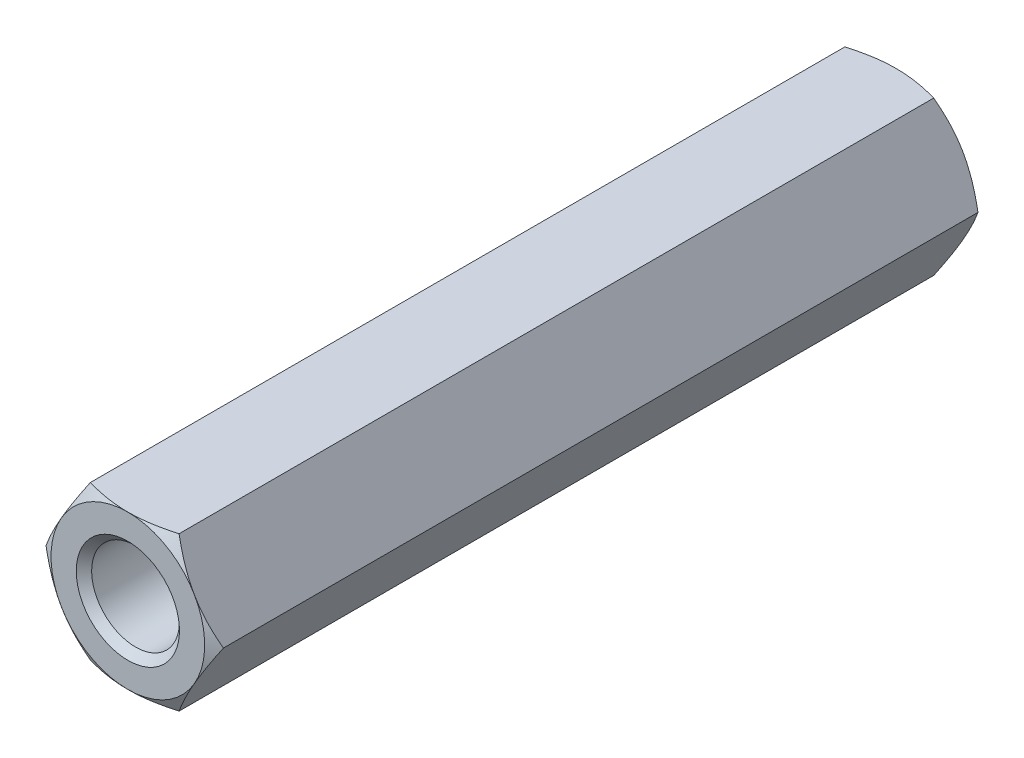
ISO-10303-21;
HEADER;
FILE_DESCRIPTION(('STEP AP214'),'2;1');
FILE_NAME('part.step','',(''),(''),'','','');
FILE_SCHEMA(('AUTOMOTIVE_DESIGN { 1 0 10303 214 1 1 1 1 }'));
ENDSEC;
DATA;
#1=APPLICATION_CONTEXT('core data for automotive mechanical design processes');
#2=APPLICATION_PROTOCOL_DEFINITION('international standard','automotive_design',2000,#1);
#3=PRODUCT_CONTEXT('',#1,'mechanical');
#4=PRODUCT('Part','Part','',(#3));
#5=PRODUCT_RELATED_PRODUCT_CATEGORY('part','',(#4));
#6=PRODUCT_DEFINITION_FORMATION('','',#4);
#7=PRODUCT_DEFINITION_CONTEXT('part definition',#1,'design');
#8=PRODUCT_DEFINITION('design','',#6,#7);
#9=PRODUCT_DEFINITION_SHAPE('','',#8);
#10=(LENGTH_UNIT() NAMED_UNIT(*) SI_UNIT(.MILLI.,.METRE.));
#11=(NAMED_UNIT(*) PLANE_ANGLE_UNIT() SI_UNIT($,.RADIAN.));
#12=(NAMED_UNIT(*) SI_UNIT($,.STERADIAN.) SOLID_ANGLE_UNIT());
#13=UNCERTAINTY_MEASURE_WITH_UNIT(LENGTH_MEASURE(1.E-05),#10,'distance_accuracy_value','');
#14=(GEOMETRIC_REPRESENTATION_CONTEXT(3) GLOBAL_UNCERTAINTY_ASSIGNED_CONTEXT((#13)) GLOBAL_UNIT_ASSIGNED_CONTEXT((#10,
#11,#12)) REPRESENTATION_CONTEXT('',''));
#15=CARTESIAN_POINT('',(0.,0.,0.));
#16=DIRECTION('',(0.,0.,1.));
#17=DIRECTION('',(1.,0.,0.));
#18=AXIS2_PLACEMENT_3D('',#15,#16,#17);
#19=CARTESIAN_POINT('',(4.04145188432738,0.,-17.5));
#20=DIRECTION('',(0.866025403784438,0.5,0.));
#21=DIRECTION('',(-0.5,0.866025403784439,0.));
#22=AXIS2_PLACEMENT_3D('',#19,#20,#21);
#23=PLANE('',#22);
#24=CARTESIAN_POINT('',(4.04156735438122,-0.00019999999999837,17.1873259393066));
#25=CARTESIAN_POINT('',(3.9527667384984,0.153607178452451,17.23861421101));
#26=CARTESIAN_POINT('',(3.86319960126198,0.308742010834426,17.2852590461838));
#27=CARTESIAN_POINT('',(3.68251437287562,0.621698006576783,17.3666781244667));
#28=CARTESIAN_POINT('',(3.59139307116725,0.779524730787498,17.4014235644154));
#29=CARTESIAN_POINT('',(3.41027974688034,1.09322221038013,17.4555099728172));
#30=CARTESIAN_POINT('',(3.32031559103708,1.24904469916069,17.4752109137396));
#31=CARTESIAN_POINT('',(3.13996396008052,1.56142288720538,17.4987298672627));
#32=CARTESIAN_POINT('',(3.04957714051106,1.71797745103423,17.5025673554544));
#33=CARTESIAN_POINT('',(2.88068384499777,2.01050921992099,17.494584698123));
#34=CARTESIAN_POINT('',(2.80215208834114,2.14653021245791,17.4847245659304));
#35=CARTESIAN_POINT('',(2.64560020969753,2.417686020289,17.4534735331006));
#36=CARTESIAN_POINT('',(2.5675806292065,2.55281989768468,17.4320719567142));
#37=CARTESIAN_POINT('',(2.41070596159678,2.82453479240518,17.3785695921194));
#38=CARTESIAN_POINT('',(2.33187072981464,2.96108141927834,17.3462420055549));
#39=CARTESIAN_POINT('',(2.17537608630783,3.2321380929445,17.272871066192));
#40=CARTESIAN_POINT('',(2.09771466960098,3.36665161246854,17.2318449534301));
#41=CARTESIAN_POINT('',(2.02061047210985,3.5002,17.1873259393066));
#42=B_SPLINE_CURVE_WITH_KNOTS('',3,(#24,#25,#26,#27,#28,#29,#30,#31,#32,#33,#34,#35,#36,#37,#38,
#39,#40,#41),.UNSPECIFIED.,.F.,.F.,(4,2,2,2,2,2,2,2,4),(0.,0.554793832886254,1.11092123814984,
1.65328467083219,2.19498204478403,2.6666513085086,3.13875761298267,3.6213361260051,
4.10296698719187),.UNSPECIFIED.);
#43=CARTESIAN_POINT('',(4.04145188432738,0.,17.1873926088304));
#44=VERTEX_POINT('',#43);
#45=CARTESIAN_POINT('',(3.03108891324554,1.75,17.5));
#46=VERTEX_POINT('',#45);
#47=EDGE_CURVE('E171',#44,#46,#42,.T.);
#48=ORIENTED_EDGE('',*,*,#47,.F.);
#49=DIRECTION('',(0.,0.,1.));
#50=VECTOR('',#49,1.);
#51=CARTESIAN_POINT('',(4.04145188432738,0.,-17.5));
#52=LINE('',#51,#50);
#53=CARTESIAN_POINT('',(4.04145188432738,0.,-17.1873926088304));
#54=VERTEX_POINT('',#53);
#55=EDGE_CURVE('E320',#54,#44,#52,.T.);
#56=ORIENTED_EDGE('',*,*,#55,.F.);
#57=CARTESIAN_POINT('',(4.04156735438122,-0.00019999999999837,-17.1873259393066));
#58=CARTESIAN_POINT('',(3.9527667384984,0.153607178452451,-17.23861421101));
#59=CARTESIAN_POINT('',(3.86319960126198,0.308742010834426,-17.2852590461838));
#60=CARTESIAN_POINT('',(3.68251437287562,0.621698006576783,-17.3666781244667));
#61=CARTESIAN_POINT('',(3.59139307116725,0.779524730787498,-17.4014235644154));
#62=CARTESIAN_POINT('',(3.41027974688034,1.09322221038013,-17.4555099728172));
#63=CARTESIAN_POINT('',(3.32031559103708,1.24904469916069,-17.4752109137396));
#64=CARTESIAN_POINT('',(3.13996396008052,1.56142288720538,-17.4987298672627));
#65=CARTESIAN_POINT('',(3.04957714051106,1.71797745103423,-17.5025673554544));
#66=CARTESIAN_POINT('',(2.88068384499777,2.01050921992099,-17.494584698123));
#67=CARTESIAN_POINT('',(2.80215208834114,2.14653021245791,-17.4847245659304));
#68=CARTESIAN_POINT('',(2.64560020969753,2.417686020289,-17.4534735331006));
#69=CARTESIAN_POINT('',(2.5675806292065,2.55281989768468,-17.4320719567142));
#70=CARTESIAN_POINT('',(2.41070596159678,2.82453479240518,-17.3785695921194));
#71=CARTESIAN_POINT('',(2.33187072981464,2.96108141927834,-17.3462420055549));
#72=CARTESIAN_POINT('',(2.17537608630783,3.2321380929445,-17.272871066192));
#73=CARTESIAN_POINT('',(2.09771466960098,3.36665161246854,-17.2318449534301));
#74=CARTESIAN_POINT('',(2.02061047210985,3.5002,-17.1873259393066));
#75=B_SPLINE_CURVE_WITH_KNOTS('',3,(#57,#58,#59,#60,#61,#62,#63,#64,#65,#66,#67,#68,#69,#70,#71,
#72,#73,#74),.UNSPECIFIED.,.F.,.F.,(4,2,2,2,2,2,2,2,4),(0.,0.554793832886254,1.11092123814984,
1.65328467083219,2.19498204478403,2.6666513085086,3.13875761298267,3.6213361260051,
4.10296698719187),.UNSPECIFIED.);
#76=CARTESIAN_POINT('',(3.03108891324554,1.75,-17.5));
#77=VERTEX_POINT('',#76);
#78=EDGE_CURVE('E304',#54,#77,#75,.T.);
#79=ORIENTED_EDGE('',*,*,#78,.T.);
#80=CARTESIAN_POINT('',(2.02072594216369,3.5,-17.1873926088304));
#81=VERTEX_POINT('',#80);
#82=EDGE_CURVE('E251',#77,#81,#75,.T.);
#83=ORIENTED_EDGE('',*,*,#82,.T.);
#84=DIRECTION('',(0.,0.,1.));
#85=VECTOR('',#84,1.);
#86=CARTESIAN_POINT('',(2.02072594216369,3.5,-17.5));
#87=LINE('',#86,#85);
#88=CARTESIAN_POINT('',(2.02072594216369,3.5,17.1873926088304));
#89=VERTEX_POINT('',#88);
#90=EDGE_CURVE('E352',#81,#89,#87,.T.);
#91=ORIENTED_EDGE('',*,*,#90,.T.);
#92=EDGE_CURVE('E147',#46,#89,#42,.T.);
#93=ORIENTED_EDGE('',*,*,#92,.F.);
#94=EDGE_LOOP('',(#48,#56,#79,#83,#91,#93));
#95=FACE_BOUND('',#94,.T.);
#96=ADVANCED_FACE('F41',(#95),#23,.T.);
#97=CARTESIAN_POINT('',(2.02072594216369,-3.5,-17.5));
#98=DIRECTION('',(0.866025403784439,-0.5,0.));
#99=DIRECTION('',(0.5,0.866025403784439,0.));
#100=AXIS2_PLACEMENT_3D('',#97,#98,#99);
#101=PLANE('',#100);
#102=CARTESIAN_POINT('',(2.02061047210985,-3.5002,17.1873259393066));
#103=CARTESIAN_POINT('',(2.10941108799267,-3.34639282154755,17.23861421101));
#104=CARTESIAN_POINT('',(2.19897822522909,-3.19125798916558,17.2852590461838));
#105=CARTESIAN_POINT('',(2.37966345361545,-2.87830199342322,17.3666781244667));
#106=CARTESIAN_POINT('',(2.47078475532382,-2.7204752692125,17.4014235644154));
#107=CARTESIAN_POINT('',(2.65189807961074,-2.40677778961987,17.4555099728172));
#108=CARTESIAN_POINT('',(2.74186223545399,-2.25095530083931,17.4752109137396));
#109=CARTESIAN_POINT('',(2.92221386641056,-1.93857711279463,17.4987298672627));
#110=CARTESIAN_POINT('',(3.01260068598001,-1.78202254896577,17.5025673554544));
#111=CARTESIAN_POINT('',(3.1814939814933,-1.48949078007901,17.494584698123));
#112=CARTESIAN_POINT('',(3.26002573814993,-1.35346978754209,17.4847245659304));
#113=CARTESIAN_POINT('',(3.41657761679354,-1.082313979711,17.4534735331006));
#114=CARTESIAN_POINT('',(3.49459719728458,-0.947180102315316,17.4320719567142));
#115=CARTESIAN_POINT('',(3.65147186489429,-0.675465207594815,17.3785695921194));
#116=CARTESIAN_POINT('',(3.73030709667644,-0.538918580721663,17.3462420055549));
#117=CARTESIAN_POINT('',(3.88680174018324,-0.267861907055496,17.272871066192));
#118=CARTESIAN_POINT('',(3.96446315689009,-0.133348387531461,17.2318449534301));
#119=CARTESIAN_POINT('',(4.04156735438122,0.000200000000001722,17.1873259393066));
#120=B_SPLINE_CURVE_WITH_KNOTS('',3,(#102,#103,#104,#105,#106,#107,#108,#109,#110,#111,#112,
#113,#114,#115,#116,#117,#118,#119),.UNSPECIFIED.,.F.,.F.,(4,2,2,2,2,2,2,2,4),(0.,
0.554793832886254,1.11092123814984,1.65328467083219,2.19498204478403,2.6666513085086,
3.13875761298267,3.6213361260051,4.10296698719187),.UNSPECIFIED.);
#121=CARTESIAN_POINT('',(2.02072594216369,-3.5,17.1873926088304));
#122=VERTEX_POINT('',#121);
#123=CARTESIAN_POINT('',(3.03108891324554,-1.75,17.5));
#124=VERTEX_POINT('',#123);
#125=EDGE_CURVE('E703',#122,#124,#120,.T.);
#126=ORIENTED_EDGE('',*,*,#125,.F.);
#127=DIRECTION('',(0.,0.,1.));
#128=VECTOR('',#127,1.);
#129=CARTESIAN_POINT('',(2.02072594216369,-3.5,-17.5));
#130=LINE('',#129,#128);
#131=CARTESIAN_POINT('',(2.02072594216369,-3.5,-17.1873926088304));
#132=VERTEX_POINT('',#131);
#133=EDGE_CURVE('E383',#132,#122,#130,.T.);
#134=ORIENTED_EDGE('',*,*,#133,.F.);
#135=CARTESIAN_POINT('',(2.02061047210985,-3.5002,-17.1873259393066));
#136=CARTESIAN_POINT('',(2.10941108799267,-3.34639282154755,-17.23861421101));
#137=CARTESIAN_POINT('',(2.19897822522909,-3.19125798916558,-17.2852590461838));
#138=CARTESIAN_POINT('',(2.37966345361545,-2.87830199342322,-17.3666781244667));
#139=CARTESIAN_POINT('',(2.47078475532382,-2.7204752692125,-17.4014235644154));
#140=CARTESIAN_POINT('',(2.65189807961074,-2.40677778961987,-17.4555099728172));
#141=CARTESIAN_POINT('',(2.74186223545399,-2.25095530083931,-17.4752109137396));
#142=CARTESIAN_POINT('',(2.92221386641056,-1.93857711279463,-17.4987298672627));
#143=CARTESIAN_POINT('',(3.01260068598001,-1.78202254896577,-17.5025673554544));
#144=CARTESIAN_POINT('',(3.1814939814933,-1.48949078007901,-17.494584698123));
#145=CARTESIAN_POINT('',(3.26002573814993,-1.35346978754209,-17.4847245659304));
#146=CARTESIAN_POINT('',(3.41657761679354,-1.082313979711,-17.4534735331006));
#147=CARTESIAN_POINT('',(3.49459719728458,-0.947180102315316,-17.4320719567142));
#148=CARTESIAN_POINT('',(3.65147186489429,-0.675465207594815,-17.3785695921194));
#149=CARTESIAN_POINT('',(3.73030709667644,-0.538918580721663,-17.3462420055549));
#150=CARTESIAN_POINT('',(3.88680174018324,-0.267861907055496,-17.272871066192));
#151=CARTESIAN_POINT('',(3.96446315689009,-0.133348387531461,-17.2318449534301));
#152=CARTESIAN_POINT('',(4.04156735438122,0.000200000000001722,-17.1873259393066));
#153=B_SPLINE_CURVE_WITH_KNOTS('',3,(#135,#136,#137,#138,#139,#140,#141,#142,#143,#144,#145,
#146,#147,#148,#149,#150,#151,#152),.UNSPECIFIED.,.F.,.F.,(4,2,2,2,2,2,2,2,4),(0.,
0.554793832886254,1.11092123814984,1.65328467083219,2.19498204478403,2.6666513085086,
3.13875761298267,3.6213361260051,4.10296698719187),.UNSPECIFIED.);
#154=CARTESIAN_POINT('',(3.03108891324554,-1.75,-17.5));
#155=VERTEX_POINT('',#154);
#156=EDGE_CURVE('E335',#132,#155,#153,.T.);
#157=ORIENTED_EDGE('',*,*,#156,.T.);
#158=EDGE_CURVE('E248',#155,#54,#153,.T.);
#159=ORIENTED_EDGE('',*,*,#158,.T.);
#160=ORIENTED_EDGE('',*,*,#55,.T.);
#161=EDGE_CURVE('E175',#124,#44,#120,.T.);
#162=ORIENTED_EDGE('',*,*,#161,.F.);
#163=EDGE_LOOP('',(#126,#134,#157,#159,#160,#162));
#164=FACE_BOUND('',#163,.T.);
#165=ADVANCED_FACE('F332',(#164),#101,.T.);
#166=CARTESIAN_POINT('',(-2.02072594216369,-3.5,-17.5));
#167=DIRECTION('',(0.,-1.,0.));
#168=DIRECTION('',(1.,0.,0.));
#169=AXIS2_PLACEMENT_3D('',#166,#167,#168);
#170=PLANE('',#169);
#171=CARTESIAN_POINT('',(-27.4307731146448,-3.50000000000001,3.55516599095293));
#172=CARTESIAN_POINT('',(-26.8478852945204,-3.50000000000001,3.88898724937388));
#173=CARTESIAN_POINT('',(-26.2649264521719,-3.50000000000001,4.22268456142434));
#174=CARTESIAN_POINT('',(-25.0988291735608,-3.50000000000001,4.88976582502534));
#175=CARTESIAN_POINT('',(-24.5156907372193,-3.50000000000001,5.22314977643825));
#176=CARTESIAN_POINT('',(-22.7659099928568,-3.50000000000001,6.22275607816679));
#177=CARTESIAN_POINT('',(-21.5989427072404,-3.50000000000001,6.88840969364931));
#178=CARTESIAN_POINT('',(-19.2608825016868,-3.50000000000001,8.21892907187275));
#179=CARTESIAN_POINT('',(-18.0897863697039,-3.50000000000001,8.88378919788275));
#180=CARTESIAN_POINT('',(-16.3313824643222,-3.50000000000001,9.87793472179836));
#181=CARTESIAN_POINT('',(-15.7449616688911,-3.50000000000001,10.2087884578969));
#182=CARTESIAN_POINT('',(-14.5712993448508,-3.50000000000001,10.8690364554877));
#183=CARTESIAN_POINT('',(-13.9840578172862,-3.50000000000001,11.1984307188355));
#184=CARTESIAN_POINT('',(-12.8083674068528,-3.5,11.8551710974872));
#185=CARTESIAN_POINT('',(-12.2199184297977,-3.5,12.1825170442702));
#186=CARTESIAN_POINT('',(-11.0412870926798,-3.5,12.8341510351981));
#187=CARTESIAN_POINT('',(-10.451104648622,-3.5,13.1584389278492));
#188=CARTESIAN_POINT('',(-9.56416132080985,-3.5,13.6409988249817));
#189=CARTESIAN_POINT('',(-9.26840501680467,-3.5,13.8011162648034));
#190=CARTESIAN_POINT('',(-8.67602835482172,-3.5,14.1197437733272));
#191=CARTESIAN_POINT('',(-8.37940800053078,-3.5,14.2782538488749));
#192=CARTESIAN_POINT('',(-7.78506999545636,-3.5,14.5931382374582));
#193=CARTESIAN_POINT('',(-7.48735245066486,-3.5,14.749512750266));
#194=CARTESIAN_POINT('',(-6.89042333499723,-3.5,15.0593801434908));
#195=CARTESIAN_POINT('',(-6.5912117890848,-3.5,15.2128730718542));
#196=CARTESIAN_POINT('',(-5.9914121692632,-3.5,15.5154882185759));
#197=CARTESIAN_POINT('',(-5.69082860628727,-3.5,15.6646193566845));
#198=CARTESIAN_POINT('',(-5.08677213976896,-3.5,15.9571138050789));
#199=CARTESIAN_POINT('',(-4.78329871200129,-3.5,16.1004760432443));
#200=CARTESIAN_POINT('',(-4.32445650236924,-3.5,16.3091784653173));
#201=CARTESIAN_POINT('',(-4.17059154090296,-3.5,16.3778203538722));
#202=CARTESIAN_POINT('',(-3.86164226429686,-3.5,16.5122961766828));
#203=CARTESIAN_POINT('',(-3.70655799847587,-3.5,16.5781302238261));
#204=CARTESIAN_POINT('',(-3.39495585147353,-3.5,16.7062535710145));
#205=CARTESIAN_POINT('',(-3.23843822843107,-3.5,16.7685434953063));
#206=CARTESIAN_POINT('',(-2.92369181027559,-3.5,16.8886149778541));
#207=CARTESIAN_POINT('',(-2.76546316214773,-3.5,16.9463969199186));
#208=CARTESIAN_POINT('',(-2.40523508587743,-3.5,17.0706153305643));
#209=CARTESIAN_POINT('',(-2.20263760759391,-3.5,17.1353482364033));
#210=CARTESIAN_POINT('',(-1.79382400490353,-3.5,17.2523701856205));
#211=CARTESIAN_POINT('',(-1.5876080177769,-3.5,17.304659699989));
#212=CARTESIAN_POINT('',(-1.1738163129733,-3.5,17.392237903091));
#213=CARTESIAN_POINT('',(-0.966280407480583,-3.5,17.4277070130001));
#214=CARTESIAN_POINT('',(-0.653209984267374,-3.5,17.4659565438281));
#215=CARTESIAN_POINT('',(-0.548566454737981,-3.5,17.4762138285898));
#216=CARTESIAN_POINT('',(-0.338886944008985,-3.5,17.4914366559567));
#217=CARTESIAN_POINT('',(-0.23385096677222,-3.5,17.4964022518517));
#218=CARTESIAN_POINT('',(-0.0226954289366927,-3.5,17.5008844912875));
#219=CARTESIAN_POINT('',(0.0834252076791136,-3.5,17.5003505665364));
#220=CARTESIAN_POINT('',(0.295492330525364,-3.5,17.493732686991));
#221=CARTESIAN_POINT('',(0.401438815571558,-3.5,17.4876486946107));
#222=CARTESIAN_POINT('',(0.612909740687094,-3.5,17.4701404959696));
#223=CARTESIAN_POINT('',(0.718434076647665,-3.5,17.4587150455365));
#224=CARTESIAN_POINT('',(0.928826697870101,-3.5,17.4308911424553));
#225=CARTESIAN_POINT('',(1.03369493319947,-3.5,17.4144923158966));
#226=CARTESIAN_POINT('',(1.24385359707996,-3.5,17.3769703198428));
#227=CARTESIAN_POINT('',(1.3491343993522,-3.5,17.3557936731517));
#228=CARTESIAN_POINT('',(1.55878625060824,-3.5,17.3093583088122));
#229=CARTESIAN_POINT('',(1.66315728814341,-3.5,17.2840995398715));
#230=CARTESIAN_POINT('',(1.87097734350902,-3.5,17.2300239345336));
#231=CARTESIAN_POINT('',(1.97442628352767,-3.5,17.2012068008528));
#232=CARTESIAN_POINT('',(2.18040838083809,-3.5,17.1405056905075));
#233=CARTESIAN_POINT('',(2.2829415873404,-3.5,17.1086218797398));
#234=CARTESIAN_POINT('',(2.58596452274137,-3.5,17.0101102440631));
#235=CARTESIAN_POINT('',(2.78523134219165,-3.5,16.9397177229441));
#236=CARTESIAN_POINT('',(3.18099665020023,-3.5,16.7914963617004));
#237=CARTESIAN_POINT('',(3.37749434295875,-3.5,16.7136654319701));
#238=CARTESIAN_POINT('',(3.76840303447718,-3.5,16.5524408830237));
#239=CARTESIAN_POINT('',(3.96281183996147,-3.5,16.4690419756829));
#240=CARTESIAN_POINT('',(4.34978417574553,-3.5,16.2981436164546));
#241=CARTESIAN_POINT('',(4.54234789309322,-3.5,16.2106445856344));
#242=CARTESIAN_POINT('',(4.92655192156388,-3.5,16.0322764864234));
#243=CARTESIAN_POINT('',(5.11818819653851,-3.5,15.9413987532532));
#244=CARTESIAN_POINT('',(5.50028894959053,-3.5,15.7572095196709));
#245=CARTESIAN_POINT('',(5.69075340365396,-3.5,15.6638979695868));
#246=CARTESIAN_POINT('',(6.26052950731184,-3.5,15.3812325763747));
#247=CARTESIAN_POINT('',(6.63843539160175,-3.5,15.1890482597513));
#248=CARTESIAN_POINT('',(7.39330119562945,-3.5,14.799050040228));
#249=CARTESIAN_POINT('',(7.77025068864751,-3.5,14.6012160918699));
#250=CARTESIAN_POINT('',(8.52243642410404,-3.5,14.2022077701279));
#251=CARTESIAN_POINT('',(8.8976724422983,-3.5,14.0010329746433));
#252=CARTESIAN_POINT('',(9.64621901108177,-3.5,13.5967028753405));
#253=CARTESIAN_POINT('',(10.0195317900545,-3.5,13.3935516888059));
#254=CARTESIAN_POINT('',(10.7652232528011,-3.5,12.9855407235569));
#255=CARTESIAN_POINT('',(11.1376019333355,-3.5,12.7806809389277));
#256=CARTESIAN_POINT('',(12.1824170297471,-3.5,12.203562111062));
#257=CARTESIAN_POINT('',(12.8540564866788,-3.5,11.8298610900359));
#258=CARTESIAN_POINT('',(14.1958864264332,-3.5,11.0798476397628));
#259=CARTESIAN_POINT('',(14.8660768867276,-3.5,10.7035351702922));
#260=CARTESIAN_POINT('',(16.2059195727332,-3.5,9.94888951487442));
#261=CARTESIAN_POINT('',(16.8755711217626,-3.5,9.57055512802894));
#262=CARTESIAN_POINT('',(18.2141715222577,-3.49999999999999,8.81264546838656));
#263=CARTESIAN_POINT('',(18.8831203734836,-3.49999999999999,8.4330701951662));
#264=CARTESIAN_POINT('',(20.2093475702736,-3.49999999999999,7.67935317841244));
#265=CARTESIAN_POINT('',(20.8666344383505,-3.49999999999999,7.30522642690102));
#266=CARTESIAN_POINT('',(22.1808319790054,-3.49999999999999,6.55631041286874));
#267=CARTESIAN_POINT('',(22.8377426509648,-3.49999999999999,6.18152114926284));
#268=CARTESIAN_POINT('',(24.1508049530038,-3.49999999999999,5.43169950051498));
#269=CARTESIAN_POINT('',(24.8069567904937,-3.49999999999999,5.05666747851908));
#270=CARTESIAN_POINT('',(26.1190260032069,-3.49999999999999,4.30619659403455));
#271=CARTESIAN_POINT('',(26.7749433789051,-3.49999999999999,3.93075773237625));
#272=CARTESIAN_POINT('',(27.4307731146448,-3.49999999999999,3.55516599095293));
#273=B_SPLINE_CURVE_WITH_KNOTS('',3,(#171,#172,#173,#174,#175,#176,#177,#178,#179,#180,#181,
#182,#183,#184,#185,#186,#187,#188,#189,#190,#191,#192,#193,#194,#195,#196,#197,#198,#199,#200,
#201,#202,#203,#204,#205,#206,#207,#208,#209,#210,#211,#212,#213,#214,#215,#216,#217,#218,#219,
#220,#221,#222,#223,#224,#225,#226,#227,#228,#229,#230,#231,#232,#233,#234,#235,#236,#237,#238,
#239,#240,#241,#242,#243,#244,#245,#246,#247,#248,#249,#250,#251,#252,#253,#254,#255,#256,#257,
#258,#259,#260,#261,#262,#263,#264,#265,#266,#267,#268,#269,#270,#271,#272),.UNSPECIFIED.,.F.,
.F.,(4,2,2,2,2,2,2,2,2,2,2,2,2,2,2,2,2,2,2,2,2,2,2,2,2,2,2,2,2,2,2,2,2,2,2,2,2,2,2,2,2,2,2,2,2,
2,2,2,2,2,4),(0.,2.01513118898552,4.03026326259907,8.06066729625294,12.1006546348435,
14.1205992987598,16.1405413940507,18.160647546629,20.180853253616,21.1898018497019,
22.1987461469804,23.2075954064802,24.2164278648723,25.2230280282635,26.2298144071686,
26.7352387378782,27.2406427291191,27.7459574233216,28.2512290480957,28.8889907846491,
29.5267283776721,30.1574613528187,30.4727817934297,30.7880990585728,31.1063182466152,
31.4245395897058,31.7428350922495,32.0611545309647,32.3832311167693,32.7053117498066,
33.0274193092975,33.3495094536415,33.9832827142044,34.6172345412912,35.2517972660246,
35.8862949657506,36.5225504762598,37.1588189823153,38.4306546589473,39.7077661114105,
40.9850401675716,42.2600622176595,43.5350886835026,45.8408897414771,48.146726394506,
50.4541322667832,52.7615389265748,55.0304526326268,57.2993700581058,59.5666718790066,
61.8339690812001),.UNSPECIFIED.);
#274=CARTESIAN_POINT('',(-2.02072594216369,-3.5,17.1873926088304));
#275=VERTEX_POINT('',#274);
#276=CARTESIAN_POINT('',(0.,-3.5,17.5));
#277=VERTEX_POINT('',#276);
#278=EDGE_CURVE('E398',#275,#277,#273,.T.);
#279=ORIENTED_EDGE('',*,*,#278,.F.);
#280=DIRECTION('',(0.,0.,1.));
#281=VECTOR('',#280,1.);
#282=CARTESIAN_POINT('',(-2.02072594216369,-3.5,-17.5));
#283=LINE('',#282,#281);
#284=CARTESIAN_POINT('',(-2.02072594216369,-3.5,-17.1873926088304));
#285=VERTEX_POINT('',#284);
#286=EDGE_CURVE('E384',#285,#275,#283,.T.);
#287=ORIENTED_EDGE('',*,*,#286,.F.);
#288=CARTESIAN_POINT('',(-15.5844804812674,-3.50000000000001,-10.2989034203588));
#289=CARTESIAN_POINT('',(-15.2452756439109,-3.50000000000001,-10.4899769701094));
#290=CARTESIAN_POINT('',(-14.9059481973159,-3.50000000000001,-10.6808333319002));
#291=CARTESIAN_POINT('',(-14.2269801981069,-3.50000000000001,-11.0619912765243));
#292=CARTESIAN_POINT('',(-13.8873396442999,-3.50000000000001,-11.2522928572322));
#293=CARTESIAN_POINT('',(-13.2076108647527,-3.50000000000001,-11.6322580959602));
#294=CARTESIAN_POINT('',(-12.8675225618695,-3.5,-11.8219216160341));
#295=CARTESIAN_POINT('',(-12.1868746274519,-3.5,-12.200400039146));
#296=CARTESIAN_POINT('',(-11.8463149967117,-3.5,-12.3892149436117));
#297=CARTESIAN_POINT('',(-11.1665311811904,-3.5,-12.7646994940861));
#298=CARTESIAN_POINT('',(-10.8273103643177,-3.5,-12.9513752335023));
#299=CARTESIAN_POINT('',(-10.148112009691,-3.5,-13.3233445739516));
#300=CARTESIAN_POINT('',(-9.80813447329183,-3.5,-13.5086381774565));
#301=CARTESIAN_POINT('',(-9.12722539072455,-3.5,-13.8773735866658));
#302=CARTESIAN_POINT('',(-8.78629395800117,-3.5,-14.0608156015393));
#303=CARTESIAN_POINT('',(-8.10310110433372,-3.5,-14.4252006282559));
#304=CARTESIAN_POINT('',(-7.76083969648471,-3.5,-14.6061436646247));
#305=CARTESIAN_POINT('',(-7.06580625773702,-3.5,-14.9690627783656));
#306=CARTESIAN_POINT('',(-6.71298725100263,-3.5,-15.1509493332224));
#307=CARTESIAN_POINT('',(-6.18164231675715,-3.5,-15.4196898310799));
#308=CARTESIAN_POINT('',(-6.00415572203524,-3.5,-15.5085976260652));
#309=CARTESIAN_POINT('',(-5.64833576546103,-3.5,-15.6847003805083));
#310=CARTESIAN_POINT('',(-5.47000241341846,-3.5,-15.7718953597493));
#311=CARTESIAN_POINT('',(-5.11111080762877,-3.5,-15.944713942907));
#312=CARTESIAN_POINT('',(-4.93054564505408,-3.5,-16.0303232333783));
#313=CARTESIAN_POINT('',(-4.56812866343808,-3.5,-16.1987670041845));
#314=CARTESIAN_POINT('',(-4.38627688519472,-3.5,-16.281601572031));
#315=CARTESIAN_POINT('',(-4.0210158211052,-3.5,-16.4436655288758));
#316=CARTESIAN_POINT('',(-3.83760690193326,-3.5,-16.5228957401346));
#317=CARTESIAN_POINT('',(-3.46883117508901,-3.5,-16.6766375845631));
#318=CARTESIAN_POINT('',(-3.28346453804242,-3.5,-16.7511496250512));
#319=CARTESIAN_POINT('',(-2.8844766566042,-3.5,-16.9038033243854));
#320=CARTESIAN_POINT('',(-2.67049635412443,-3.5,-16.9810195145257));
#321=CARTESIAN_POINT('',(-2.23870338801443,-3.5,-17.124163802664));
#322=CARTESIAN_POINT('',(-2.02089019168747,-3.5,-17.1900903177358));
#323=CARTESIAN_POINT('',(-1.58382449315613,-3.5,-17.3055225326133));
#324=CARTESIAN_POINT('',(-1.36462747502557,-3.5,-17.3552304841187));
#325=CARTESIAN_POINT('',(-1.0331648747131,-3.5,-17.414672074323));
#326=CARTESIAN_POINT('',(-0.922243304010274,-3.5,-17.4319649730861));
#327=CARTESIAN_POINT('',(-0.699680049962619,-3.5,-17.4609676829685));
#328=CARTESIAN_POINT('',(-0.588038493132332,-3.5,-17.4726784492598));
#329=CARTESIAN_POINT('',(-0.362202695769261,-3.5,-17.4902543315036));
#330=CARTESIAN_POINT('',(-0.247999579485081,-3.5,-17.496006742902));
#331=CARTESIAN_POINT('',(-0.0194502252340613,-3.5,-17.5010445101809));
#332=CARTESIAN_POINT('',(0.0948960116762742,-3.5,-17.5003299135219));
#333=CARTESIAN_POINT('',(0.323373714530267,-3.5,-17.4924617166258));
#334=CARTESIAN_POINT('',(0.437505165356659,-3.5,-17.4853076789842));
#335=CARTESIAN_POINT('',(0.665204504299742,-3.5,-17.4648539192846));
#336=CARTESIAN_POINT('',(0.778772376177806,-3.5,-17.4515540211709));
#337=CARTESIAN_POINT('',(1.12102809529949,-3.5,-17.4027463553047));
#338=CARTESIAN_POINT('',(1.34849603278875,-3.5,-17.3584444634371));
#339=CARTESIAN_POINT('',(1.68635720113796,-3.5,-17.2784669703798));
#340=CARTESIAN_POINT('',(1.79845994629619,-3.5,-17.2495410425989));
#341=CARTESIAN_POINT('',(2.02159924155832,-3.5,-17.1878238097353));
#342=CARTESIAN_POINT('',(2.1326358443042,-3.5,-17.155032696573));
#343=CARTESIAN_POINT('',(2.43075829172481,-3.5,-17.0621643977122));
#344=CARTESIAN_POINT('',(2.6168801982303,-3.5,-16.9990055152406));
#345=CARTESIAN_POINT('',(2.98658767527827,-3.5,-16.8656116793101));
#346=CARTESIAN_POINT('',(3.17017257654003,-3.5,-16.7953748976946));
#347=CARTESIAN_POINT('',(3.53538002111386,-3.5,-16.6495174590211));
#348=CARTESIAN_POINT('',(3.71700053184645,-3.5,-16.5738917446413));
#349=CARTESIAN_POINT('',(4.07847905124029,-3.5,-16.4186070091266));
#350=CARTESIAN_POINT('',(4.25833722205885,-3.5,-16.3389483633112));
#351=CARTESIAN_POINT('',(4.6171061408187,-3.5,-16.176312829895));
#352=CARTESIAN_POINT('',(4.79601320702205,-3.5,-16.0933278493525));
#353=CARTESIAN_POINT('',(5.15267432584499,-3.5,-15.9249152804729));
#354=CARTESIAN_POINT('',(5.33042835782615,-3.5,-15.8394876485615));
#355=CARTESIAN_POINT('',(5.86209855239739,-3.5,-15.5804292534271));
#356=CARTESIAN_POINT('',(6.2146171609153,-3.5,-15.4039334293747));
#357=CARTESIAN_POINT('',(6.918512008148,-3.5,-15.0452916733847));
#358=CARTESIAN_POINT('',(7.26987817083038,-3.5,-14.8631261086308));
#359=CARTESIAN_POINT('',(7.97085512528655,-3.5,-14.4953518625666));
#360=CARTESIAN_POINT('',(8.3204656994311,-3.5,-14.3097427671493));
#361=CARTESIAN_POINT('',(9.01784108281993,-3.5,-13.9363878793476));
#362=CARTESIAN_POINT('',(9.36560791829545,-3.5,-13.7486458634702));
#363=CARTESIAN_POINT('',(10.0601754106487,-3.5,-13.3713819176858));
#364=CARTESIAN_POINT('',(10.4069760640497,-3.5,-13.1818599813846));
#365=CARTESIAN_POINT('',(11.1587907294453,-3.5,-12.7691123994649));
#366=CARTESIAN_POINT('',(11.5636687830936,-3.5,-12.5456392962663));
#367=CARTESIAN_POINT('',(12.3728327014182,-3.5,-12.0972466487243));
#368=CARTESIAN_POINT('',(12.7771182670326,-3.5,-11.872326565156));
#369=CARTESIAN_POINT('',(13.5822471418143,-3.5,-11.4230554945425));
#370=CARTESIAN_POINT('',(13.9830945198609,-3.5,-11.198711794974));
#371=CARTESIAN_POINT('',(14.7841769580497,-3.5,-10.7493114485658));
#372=CARTESIAN_POINT('',(15.1844121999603,-3.5,-10.5242551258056));
#373=CARTESIAN_POINT('',(15.5844804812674,-3.5,-10.2989034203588));
#374=B_SPLINE_CURVE_WITH_KNOTS('',3,(#288,#289,#290,#291,#292,#293,#294,#295,#296,#297,#298,
#299,#300,#301,#302,#303,#304,#305,#306,#307,#308,#309,#310,#311,#312,#313,#314,#315,#316,#317,
#318,#319,#320,#321,#322,#323,#324,#325,#326,#327,#328,#329,#330,#331,#332,#333,#334,#335,#336,
#337,#338,#339,#340,#341,#342,#343,#344,#345,#346,#347,#348,#349,#350,#351,#352,#353,#354,#355,
#356,#357,#358,#359,#360,#361,#362,#363,#364,#365,#366,#367,#368,#369,#370,#371,#372,#373),
.UNSPECIFIED.,.F.,.F.,(4,2,2,2,2,2,2,2,2,2,2,2,2,2,2,2,2,2,2,2,2,2,2,2,2,2,2,2,2,2,2,2,2,2,2,2,
2,2,2,2,2,2,4),(0.,1.16795626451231,2.33591699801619,3.50411581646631,4.67231266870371,
5.83388988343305,6.99546502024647,8.1569074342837,9.31833844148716,10.5091305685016,
11.1046525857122,11.700167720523,12.2996447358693,12.8991028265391,13.4984234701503,
14.0976923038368,14.7799197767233,15.4622428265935,16.1356992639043,16.4723646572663,
16.8089724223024,17.1518370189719,17.4946990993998,17.8375844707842,18.180479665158,
18.8745527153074,19.221835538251,19.5691011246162,20.1585328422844,20.7481171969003,
21.338262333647,21.9283526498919,22.5199780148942,23.1116139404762,24.2942439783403,
25.48156449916,26.6690287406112,27.8546442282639,29.0402639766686,30.4276313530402,
31.8155497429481,33.1936192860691,34.5711329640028),.UNSPECIFIED.);
#375=CARTESIAN_POINT('',(0.,-3.5,-17.5));
#376=VERTEX_POINT('',#375);
#377=EDGE_CURVE('E345',#285,#376,#374,.T.);
#378=ORIENTED_EDGE('',*,*,#377,.T.);
#379=EDGE_CURVE('E276',#376,#132,#374,.T.);
#380=ORIENTED_EDGE('',*,*,#379,.T.);
#381=ORIENTED_EDGE('',*,*,#133,.T.);
#382=EDGE_CURVE('E211',#277,#122,#273,.T.);
#383=ORIENTED_EDGE('',*,*,#382,.F.);
#384=EDGE_LOOP('',(#279,#287,#378,#380,#381,#383));
#385=FACE_BOUND('',#384,.T.);
#386=ADVANCED_FACE('F234',(#385),#170,.T.);
#387=CARTESIAN_POINT('',(-4.04145188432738,0.,-17.5));
#388=DIRECTION('',(-0.866025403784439,-0.5,0.));
#389=DIRECTION('',(0.5,-0.866025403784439,0.));
#390=AXIS2_PLACEMENT_3D('',#387,#388,#389);
#391=PLANE('',#390);
#392=CARTESIAN_POINT('',(-4.04156735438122,0.000199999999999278,17.1873259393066));
#393=CARTESIAN_POINT('',(-3.9527667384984,-0.15360717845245,17.23861421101));
#394=CARTESIAN_POINT('',(-3.86319960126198,-0.308742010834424,17.2852590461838));
#395=CARTESIAN_POINT('',(-3.68251437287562,-0.621698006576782,17.3666781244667));
#396=CARTESIAN_POINT('',(-3.59139307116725,-0.779524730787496,17.4014235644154));
#397=CARTESIAN_POINT('',(-3.41027974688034,-1.09322221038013,17.4555099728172));
#398=CARTESIAN_POINT('',(-3.32031559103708,-1.24904469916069,17.4752109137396));
#399=CARTESIAN_POINT('',(-3.13996396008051,-1.56142288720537,17.4987298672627));
#400=CARTESIAN_POINT('',(-3.04957714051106,-1.71797745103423,17.5025673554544));
#401=CARTESIAN_POINT('',(-2.88068384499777,-2.01050921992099,17.494584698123));
#402=CARTESIAN_POINT('',(-2.80215208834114,-2.14653021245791,17.4847245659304));
#403=CARTESIAN_POINT('',(-2.64560020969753,-2.417686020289,17.4534735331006));
#404=CARTESIAN_POINT('',(-2.56758062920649,-2.55281989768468,17.4320719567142));
#405=CARTESIAN_POINT('',(-2.41070596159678,-2.82453479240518,17.3785695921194));
#406=CARTESIAN_POINT('',(-2.33187072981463,-2.96108141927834,17.3462420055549));
#407=CARTESIAN_POINT('',(-2.17537608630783,-3.2321380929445,17.272871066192));
#408=CARTESIAN_POINT('',(-2.09771466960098,-3.36665161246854,17.2318449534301));
#409=CARTESIAN_POINT('',(-2.02061047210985,-3.5002,17.1873259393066));
#410=B_SPLINE_CURVE_WITH_KNOTS('',3,(#392,#393,#394,#395,#396,#397,#398,#399,#400,#401,#402,
#403,#404,#405,#406,#407,#408,#409),.UNSPECIFIED.,.F.,.F.,(4,2,2,2,2,2,2,2,4),(0.,
0.554793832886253,1.11092123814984,1.65328467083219,2.19498204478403,2.6666513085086,
3.13875761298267,3.6213361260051,4.10296698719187),.UNSPECIFIED.);
#411=CARTESIAN_POINT('',(-4.04145188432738,0.,17.1873926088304));
#412=VERTEX_POINT('',#411);
#413=CARTESIAN_POINT('',(-3.03108891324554,-1.75,17.5));
#414=VERTEX_POINT('',#413);
#415=EDGE_CURVE('E156',#412,#414,#410,.T.);
#416=ORIENTED_EDGE('',*,*,#415,.F.);
#417=DIRECTION('',(0.,0.,1.));
#418=VECTOR('',#417,1.);
#419=CARTESIAN_POINT('',(-4.04145188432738,0.,-17.5));
#420=LINE('',#419,#418);
#421=CARTESIAN_POINT('',(-4.04145188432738,0.,-17.1873926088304));
#422=VERTEX_POINT('',#421);
#423=EDGE_CURVE('E169',#422,#412,#420,.T.);
#424=ORIENTED_EDGE('',*,*,#423,.F.);
#425=CARTESIAN_POINT('',(-4.04156735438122,0.000199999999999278,-17.1873259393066));
#426=CARTESIAN_POINT('',(-3.9527667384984,-0.15360717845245,-17.23861421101));
#427=CARTESIAN_POINT('',(-3.86319960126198,-0.308742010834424,-17.2852590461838));
#428=CARTESIAN_POINT('',(-3.68251437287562,-0.621698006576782,-17.3666781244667));
#429=CARTESIAN_POINT('',(-3.59139307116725,-0.779524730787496,-17.4014235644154));
#430=CARTESIAN_POINT('',(-3.41027974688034,-1.09322221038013,-17.4555099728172));
#431=CARTESIAN_POINT('',(-3.32031559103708,-1.24904469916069,-17.4752109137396));
#432=CARTESIAN_POINT('',(-3.13996396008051,-1.56142288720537,-17.4987298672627));
#433=CARTESIAN_POINT('',(-3.04957714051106,-1.71797745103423,-17.5025673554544));
#434=CARTESIAN_POINT('',(-2.88068384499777,-2.01050921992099,-17.494584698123));
#435=CARTESIAN_POINT('',(-2.80215208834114,-2.14653021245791,-17.4847245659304));
#436=CARTESIAN_POINT('',(-2.64560020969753,-2.417686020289,-17.4534735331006));
#437=CARTESIAN_POINT('',(-2.56758062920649,-2.55281989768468,-17.4320719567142));
#438=CARTESIAN_POINT('',(-2.41070596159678,-2.82453479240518,-17.3785695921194));
#439=CARTESIAN_POINT('',(-2.33187072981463,-2.96108141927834,-17.3462420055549));
#440=CARTESIAN_POINT('',(-2.17537608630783,-3.2321380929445,-17.272871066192));
#441=CARTESIAN_POINT('',(-2.09771466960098,-3.36665161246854,-17.2318449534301));
#442=CARTESIAN_POINT('',(-2.02061047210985,-3.5002,-17.1873259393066));
#443=B_SPLINE_CURVE_WITH_KNOTS('',3,(#425,#426,#427,#428,#429,#430,#431,#432,#433,#434,#435,
#436,#437,#438,#439,#440,#441,#442),.UNSPECIFIED.,.F.,.F.,(4,2,2,2,2,2,2,2,4),(0.,
0.554793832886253,1.11092123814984,1.65328467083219,2.19498204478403,2.6666513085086,
3.13875761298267,3.6213361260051,4.10296698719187),.UNSPECIFIED.);
#444=CARTESIAN_POINT('',(-3.03108891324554,-1.75,-17.5));
#445=VERTEX_POINT('',#444);
#446=EDGE_CURVE('E239',#422,#445,#443,.T.);
#447=ORIENTED_EDGE('',*,*,#446,.T.);
#448=EDGE_CURVE('E250',#445,#285,#443,.T.);
#449=ORIENTED_EDGE('',*,*,#448,.T.);
#450=ORIENTED_EDGE('',*,*,#286,.T.);
#451=EDGE_CURVE('E177',#414,#275,#410,.T.);
#452=ORIENTED_EDGE('',*,*,#451,.F.);
#453=EDGE_LOOP('',(#416,#424,#447,#449,#450,#452));
#454=FACE_BOUND('',#453,.T.);
#455=ADVANCED_FACE('F231',(#454),#391,.T.);
#456=CARTESIAN_POINT('',(-2.02072594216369,3.5,-17.5));
#457=DIRECTION('',(-0.866025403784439,0.5,0.));
#458=DIRECTION('',(-0.5,-0.866025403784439,0.));
#459=AXIS2_PLACEMENT_3D('',#456,#457,#458);
#460=PLANE('',#459);
#461=CARTESIAN_POINT('',(-2.02061047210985,3.5002,17.1873259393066));
#462=CARTESIAN_POINT('',(-2.10941108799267,3.34639282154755,17.23861421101));
#463=CARTESIAN_POINT('',(-2.19897822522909,3.19125798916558,17.2852590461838));
#464=CARTESIAN_POINT('',(-2.37966345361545,2.87830199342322,17.3666781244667));
#465=CARTESIAN_POINT('',(-2.47078475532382,2.7204752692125,17.4014235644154));
#466=CARTESIAN_POINT('',(-2.65189807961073,2.40677778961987,17.4555099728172));
#467=CARTESIAN_POINT('',(-2.74186223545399,2.25095530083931,17.4752109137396));
#468=CARTESIAN_POINT('',(-2.92221386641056,1.93857711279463,17.4987298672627));
#469=CARTESIAN_POINT('',(-3.01260068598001,1.78202254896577,17.5025673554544));
#470=CARTESIAN_POINT('',(-3.1814939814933,1.48949078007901,17.494584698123));
#471=CARTESIAN_POINT('',(-3.26002573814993,1.35346978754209,17.4847245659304));
#472=CARTESIAN_POINT('',(-3.41657761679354,1.082313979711,17.4534735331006));
#473=CARTESIAN_POINT('',(-3.49459719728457,0.947180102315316,17.4320719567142));
#474=CARTESIAN_POINT('',(-3.65147186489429,0.675465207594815,17.3785695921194));
#475=CARTESIAN_POINT('',(-3.73030709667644,0.538918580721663,17.3462420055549));
#476=CARTESIAN_POINT('',(-3.88680174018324,0.267861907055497,17.272871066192));
#477=CARTESIAN_POINT('',(-3.96446315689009,0.133348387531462,17.2318449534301));
#478=CARTESIAN_POINT('',(-4.04156735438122,-0.000200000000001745,17.1873259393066));
#479=B_SPLINE_CURVE_WITH_KNOTS('',3,(#461,#462,#463,#464,#465,#466,#467,#468,#469,#470,#471,
#472,#473,#474,#475,#476,#477,#478),.UNSPECIFIED.,.F.,.F.,(4,2,2,2,2,2,2,2,4),(0.,
0.554793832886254,1.11092123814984,1.65328467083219,2.19498204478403,2.6666513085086,
3.13875761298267,3.6213361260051,4.10296698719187),.UNSPECIFIED.);
#480=CARTESIAN_POINT('',(-2.02072594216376,3.5,17.1873926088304));
#481=VERTEX_POINT('',#480);
#482=CARTESIAN_POINT('',(-3.03108891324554,1.75,17.5));
#483=VERTEX_POINT('',#482);
#484=EDGE_CURVE('E135',#481,#483,#479,.T.);
#485=ORIENTED_EDGE('',*,*,#484,.F.);
#486=DIRECTION('',(0.,0.,1.));
#487=VECTOR('',#486,1.);
#488=CARTESIAN_POINT('',(-2.02072594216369,3.5,-17.5));
#489=LINE('',#488,#487);
#490=CARTESIAN_POINT('',(-2.02072594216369,3.5,-17.1873926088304));
#491=VERTEX_POINT('',#490);
#492=EDGE_CURVE('E355',#491,#481,#489,.T.);
#493=ORIENTED_EDGE('',*,*,#492,.F.);
#494=CARTESIAN_POINT('',(-2.02061047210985,3.5002,-17.1873259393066));
#495=CARTESIAN_POINT('',(-2.10941108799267,3.34639282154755,-17.23861421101));
#496=CARTESIAN_POINT('',(-2.19897822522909,3.19125798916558,-17.2852590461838));
#497=CARTESIAN_POINT('',(-2.37966345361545,2.87830199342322,-17.3666781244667));
#498=CARTESIAN_POINT('',(-2.47078475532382,2.7204752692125,-17.4014235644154));
#499=CARTESIAN_POINT('',(-2.65189807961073,2.40677778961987,-17.4555099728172));
#500=CARTESIAN_POINT('',(-2.74186223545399,2.25095530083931,-17.4752109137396));
#501=CARTESIAN_POINT('',(-2.92221386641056,1.93857711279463,-17.4987298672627));
#502=CARTESIAN_POINT('',(-3.01260068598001,1.78202254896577,-17.5025673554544));
#503=CARTESIAN_POINT('',(-3.1814939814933,1.48949078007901,-17.494584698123));
#504=CARTESIAN_POINT('',(-3.26002573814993,1.35346978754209,-17.4847245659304));
#505=CARTESIAN_POINT('',(-3.41657761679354,1.082313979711,-17.4534735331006));
#506=CARTESIAN_POINT('',(-3.49459719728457,0.947180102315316,-17.4320719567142));
#507=CARTESIAN_POINT('',(-3.65147186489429,0.675465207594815,-17.3785695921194));
#508=CARTESIAN_POINT('',(-3.73030709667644,0.538918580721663,-17.3462420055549));
#509=CARTESIAN_POINT('',(-3.88680174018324,0.267861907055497,-17.272871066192));
#510=CARTESIAN_POINT('',(-3.96446315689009,0.133348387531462,-17.2318449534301));
#511=CARTESIAN_POINT('',(-4.04156735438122,-0.000200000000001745,-17.1873259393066));
#512=B_SPLINE_CURVE_WITH_KNOTS('',3,(#494,#495,#496,#497,#498,#499,#500,#501,#502,#503,#504,
#505,#506,#507,#508,#509,#510,#511),.UNSPECIFIED.,.F.,.F.,(4,2,2,2,2,2,2,2,4),(0.,
0.554793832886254,1.11092123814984,1.65328467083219,2.19498204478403,2.6666513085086,
3.13875761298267,3.6213361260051,4.10296698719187),.UNSPECIFIED.);
#513=CARTESIAN_POINT('',(-3.03108891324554,1.75,-17.5));
#514=VERTEX_POINT('',#513);
#515=EDGE_CURVE('E292',#491,#514,#512,.T.);
#516=ORIENTED_EDGE('',*,*,#515,.T.);
#517=EDGE_CURVE('E249',#514,#422,#512,.T.);
#518=ORIENTED_EDGE('',*,*,#517,.T.);
#519=ORIENTED_EDGE('',*,*,#423,.T.);
#520=EDGE_CURVE('E150',#483,#412,#479,.T.);
#521=ORIENTED_EDGE('',*,*,#520,.F.);
#522=EDGE_LOOP('',(#485,#493,#516,#518,#519,#521));
#523=FACE_BOUND('',#522,.T.);
#524=ADVANCED_FACE('F166',(#523),#460,.T.);
#525=CARTESIAN_POINT('',(2.02072594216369,3.5,-17.5));
#526=DIRECTION('',(0.,1.,0.));
#527=DIRECTION('',(0.,0.,1.));
#528=AXIS2_PLACEMENT_3D('',#525,#526,#527);
#529=PLANE('',#528);
#530=CARTESIAN_POINT('',(27.4307731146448,3.5,3.55516599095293));
#531=CARTESIAN_POINT('',(26.8478852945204,3.5,3.88898724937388));
#532=CARTESIAN_POINT('',(26.2649264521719,3.5,4.22268456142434));
#533=CARTESIAN_POINT('',(25.0988291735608,3.5,4.88976582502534));
#534=CARTESIAN_POINT('',(24.5156907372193,3.5,5.22314977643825));
#535=CARTESIAN_POINT('',(22.7659099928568,3.5,6.22275607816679));
#536=CARTESIAN_POINT('',(21.5989427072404,3.5,6.88840969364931));
#537=CARTESIAN_POINT('',(19.2608825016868,3.5,8.21892907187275));
#538=CARTESIAN_POINT('',(18.0897863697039,3.5,8.88378919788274));
#539=CARTESIAN_POINT('',(16.3313824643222,3.5,9.87793472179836));
#540=CARTESIAN_POINT('',(15.7449616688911,3.5,10.2087884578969));
#541=CARTESIAN_POINT('',(14.5712993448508,3.5,10.8690364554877));
#542=CARTESIAN_POINT('',(13.9840578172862,3.5,11.1984307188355));
#543=CARTESIAN_POINT('',(12.8083674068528,3.5,11.8551710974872));
#544=CARTESIAN_POINT('',(12.2199184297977,3.5,12.1825170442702));
#545=CARTESIAN_POINT('',(11.0412870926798,3.5,12.8341510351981));
#546=CARTESIAN_POINT('',(10.451104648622,3.5,13.1584389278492));
#547=CARTESIAN_POINT('',(9.56416132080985,3.5,13.6409988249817));
#548=CARTESIAN_POINT('',(9.26840501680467,3.5,13.8011162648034));
#549=CARTESIAN_POINT('',(8.67602835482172,3.5,14.1197437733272));
#550=CARTESIAN_POINT('',(8.37940800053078,3.5,14.2782538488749));
#551=CARTESIAN_POINT('',(7.78506999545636,3.5,14.5931382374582));
#552=CARTESIAN_POINT('',(7.48735245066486,3.5,14.749512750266));
#553=CARTESIAN_POINT('',(6.89042333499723,3.5,15.0593801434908));
#554=CARTESIAN_POINT('',(6.5912117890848,3.5,15.2128730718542));
#555=CARTESIAN_POINT('',(5.9914121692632,3.5,15.5154882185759));
#556=CARTESIAN_POINT('',(5.69082860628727,3.5,15.6646193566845));
#557=CARTESIAN_POINT('',(5.08677213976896,3.5,15.9571138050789));
#558=CARTESIAN_POINT('',(4.78329871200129,3.5,16.1004760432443));
#559=CARTESIAN_POINT('',(4.32445650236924,3.5,16.3091784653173));
#560=CARTESIAN_POINT('',(4.17059154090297,3.5,16.3778203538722));
#561=CARTESIAN_POINT('',(3.86164226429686,3.5,16.5122961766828));
#562=CARTESIAN_POINT('',(3.70655799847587,3.5,16.5781302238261));
#563=CARTESIAN_POINT('',(3.39495585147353,3.5,16.7062535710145));
#564=CARTESIAN_POINT('',(3.23843822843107,3.5,16.7685434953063));
#565=CARTESIAN_POINT('',(2.92369181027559,3.5,16.8886149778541));
#566=CARTESIAN_POINT('',(2.76546316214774,3.5,16.9463969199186));
#567=CARTESIAN_POINT('',(2.40523508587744,3.5,17.0706153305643));
#568=CARTESIAN_POINT('',(2.20263760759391,3.5,17.1353482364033));
#569=CARTESIAN_POINT('',(1.79382400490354,3.5,17.2523701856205));
#570=CARTESIAN_POINT('',(1.5876080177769,3.5,17.304659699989));
#571=CARTESIAN_POINT('',(1.1738163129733,3.5,17.392237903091));
#572=CARTESIAN_POINT('',(0.966280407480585,3.5,17.4277070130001));
#573=CARTESIAN_POINT('',(0.653209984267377,3.5,17.4659565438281));
#574=CARTESIAN_POINT('',(0.548566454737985,3.5,17.4762138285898));
#575=CARTESIAN_POINT('',(0.338886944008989,3.5,17.4914366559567));
#576=CARTESIAN_POINT('',(0.233850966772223,3.5,17.4964022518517));
#577=CARTESIAN_POINT('',(0.0226954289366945,3.5,17.5008844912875));
#578=CARTESIAN_POINT('',(-0.0834252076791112,3.5,17.5003505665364));
#579=CARTESIAN_POINT('',(-0.29549233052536,3.5,17.493732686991));
#580=CARTESIAN_POINT('',(-0.401438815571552,3.5,17.4876486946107));
#581=CARTESIAN_POINT('',(-0.612909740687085,3.5,17.4701404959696));
#582=CARTESIAN_POINT('',(-0.718434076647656,3.5,17.4587150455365));
#583=CARTESIAN_POINT('',(-0.928826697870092,3.5,17.4308911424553));
#584=CARTESIAN_POINT('',(-1.03369493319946,3.5,17.4144923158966));
#585=CARTESIAN_POINT('',(-1.24385359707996,3.5,17.3769703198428));
#586=CARTESIAN_POINT('',(-1.34913439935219,3.5,17.3557936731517));
#587=CARTESIAN_POINT('',(-1.55878625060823,3.5,17.3093583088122));
#588=CARTESIAN_POINT('',(-1.6631572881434,3.5,17.2840995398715));
#589=CARTESIAN_POINT('',(-1.87097734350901,3.5,17.2300239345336));
#590=CARTESIAN_POINT('',(-1.97442628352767,3.5,17.2012068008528));
#591=CARTESIAN_POINT('',(-2.18040838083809,3.5,17.1405056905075));
#592=CARTESIAN_POINT('',(-2.2829415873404,3.5,17.1086218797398));
#593=CARTESIAN_POINT('',(-2.58596452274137,3.5,17.0101102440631));
#594=CARTESIAN_POINT('',(-2.78523134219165,3.5,16.9397177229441));
#595=CARTESIAN_POINT('',(-3.18099665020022,3.5,16.7914963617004));
#596=CARTESIAN_POINT('',(-3.37749434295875,3.5,16.7136654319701));
#597=CARTESIAN_POINT('',(-3.76840303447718,3.5,16.5524408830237));
#598=CARTESIAN_POINT('',(-3.96281183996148,3.5,16.4690419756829));
#599=CARTESIAN_POINT('',(-4.34978417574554,3.5,16.2981436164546));
#600=CARTESIAN_POINT('',(-4.54234789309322,3.5,16.2106445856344));
#601=CARTESIAN_POINT('',(-4.92655192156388,3.5,16.0322764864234));
#602=CARTESIAN_POINT('',(-5.11818819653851,3.5,15.9413987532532));
#603=CARTESIAN_POINT('',(-5.50028894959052,3.5,15.7572095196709));
#604=CARTESIAN_POINT('',(-5.69075340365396,3.5,15.6638979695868));
#605=CARTESIAN_POINT('',(-6.26052950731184,3.5,15.3812325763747));
#606=CARTESIAN_POINT('',(-6.63843539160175,3.5,15.1890482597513));
#607=CARTESIAN_POINT('',(-7.39330119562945,3.5,14.799050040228));
#608=CARTESIAN_POINT('',(-7.77025068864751,3.5,14.6012160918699));
#609=CARTESIAN_POINT('',(-8.52243642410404,3.5,14.2022077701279));
#610=CARTESIAN_POINT('',(-8.8976724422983,3.5,14.0010329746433));
#611=CARTESIAN_POINT('',(-9.64621901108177,3.5,13.5967028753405));
#612=CARTESIAN_POINT('',(-10.0195317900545,3.5,13.3935516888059));
#613=CARTESIAN_POINT('',(-10.7652232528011,3.5,12.9855407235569));
#614=CARTESIAN_POINT('',(-11.1376019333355,3.5,12.7806809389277));
#615=CARTESIAN_POINT('',(-12.1824170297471,3.5,12.203562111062));
#616=CARTESIAN_POINT('',(-12.8540564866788,3.5,11.8298610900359));
#617=CARTESIAN_POINT('',(-14.1958864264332,3.5,11.0798476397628));
#618=CARTESIAN_POINT('',(-14.8660768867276,3.5,10.7035351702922));
#619=CARTESIAN_POINT('',(-16.2059195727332,3.5,9.94888951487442));
#620=CARTESIAN_POINT('',(-16.8755711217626,3.5,9.57055512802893));
#621=CARTESIAN_POINT('',(-18.2141715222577,3.5,8.81264546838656));
#622=CARTESIAN_POINT('',(-18.8831203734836,3.5,8.4330701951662));
#623=CARTESIAN_POINT('',(-20.2093475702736,3.5,7.67935317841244));
#624=CARTESIAN_POINT('',(-20.8666344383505,3.5,7.30522642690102));
#625=CARTESIAN_POINT('',(-22.1808319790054,3.5,6.55631041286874));
#626=CARTESIAN_POINT('',(-22.8377426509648,3.5,6.18152114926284));
#627=CARTESIAN_POINT('',(-24.1508049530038,3.5,5.43169950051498));
#628=CARTESIAN_POINT('',(-24.8069567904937,3.5,5.05666747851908));
#629=CARTESIAN_POINT('',(-26.1190260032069,3.5,4.30619659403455));
#630=CARTESIAN_POINT('',(-26.7749433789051,3.5,3.93075773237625));
#631=CARTESIAN_POINT('',(-27.4307731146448,3.5,3.55516599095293));
#632=B_SPLINE_CURVE_WITH_KNOTS('',3,(#530,#531,#532,#533,#534,#535,#536,#537,#538,#539,#540,
#541,#542,#543,#544,#545,#546,#547,#548,#549,#550,#551,#552,#553,#554,#555,#556,#557,#558,#559,
#560,#561,#562,#563,#564,#565,#566,#567,#568,#569,#570,#571,#572,#573,#574,#575,#576,#577,#578,
#579,#580,#581,#582,#583,#584,#585,#586,#587,#588,#589,#590,#591,#592,#593,#594,#595,#596,#597,
#598,#599,#600,#601,#602,#603,#604,#605,#606,#607,#608,#609,#610,#611,#612,#613,#614,#615,#616,
#617,#618,#619,#620,#621,#622,#623,#624,#625,#626,#627,#628,#629,#630,#631),.UNSPECIFIED.,.F.,
.F.,(4,2,2,2,2,2,2,2,2,2,2,2,2,2,2,2,2,2,2,2,2,2,2,2,2,2,2,2,2,2,2,2,2,2,2,2,2,2,2,2,2,2,2,2,2,
2,2,2,2,2,4),(0.,2.01513118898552,4.03026326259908,8.06066729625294,12.1006546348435,
14.1205992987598,16.1405413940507,18.160647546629,20.180853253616,21.1898018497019,
22.1987461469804,23.2075954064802,24.2164278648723,25.2230280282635,26.2298144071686,
26.7352387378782,27.2406427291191,27.7459574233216,28.2512290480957,28.8889907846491,
29.5267283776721,30.1574613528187,30.4727817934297,30.7880990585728,31.1063182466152,
31.4245395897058,31.7428350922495,32.0611545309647,32.3832311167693,32.7053117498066,
33.0274193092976,33.3495094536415,33.9832827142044,34.6172345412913,35.2517972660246,
35.8862949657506,36.5225504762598,37.1588189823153,38.4306546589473,39.7077661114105,
40.9850401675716,42.2600622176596,43.5350886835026,45.8408897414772,48.146726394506,
50.4541322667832,52.7615389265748,55.0304526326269,57.2993700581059,59.5666718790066,
61.8339690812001),.UNSPECIFIED.);
#633=CARTESIAN_POINT('',(0.,3.5,17.5));
#634=VERTEX_POINT('',#633);
#635=EDGE_CURVE('E148',#89,#634,#632,.T.);
#636=ORIENTED_EDGE('',*,*,#635,.F.);
#637=ORIENTED_EDGE('',*,*,#90,.F.);
#638=CARTESIAN_POINT('',(15.5844804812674,3.5,-10.2989034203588));
#639=CARTESIAN_POINT('',(15.2452756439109,3.5,-10.4899769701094));
#640=CARTESIAN_POINT('',(14.9059481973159,3.5,-10.6808333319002));
#641=CARTESIAN_POINT('',(14.2269801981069,3.5,-11.0619912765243));
#642=CARTESIAN_POINT('',(13.8873396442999,3.5,-11.2522928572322));
#643=CARTESIAN_POINT('',(13.2076108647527,3.5,-11.6322580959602));
#644=CARTESIAN_POINT('',(12.8675225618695,3.5,-11.8219216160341));
#645=CARTESIAN_POINT('',(12.1868746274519,3.5,-12.200400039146));
#646=CARTESIAN_POINT('',(11.8463149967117,3.5,-12.3892149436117));
#647=CARTESIAN_POINT('',(11.1665311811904,3.5,-12.7646994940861));
#648=CARTESIAN_POINT('',(10.8273103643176,3.5,-12.9513752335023));
#649=CARTESIAN_POINT('',(10.148112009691,3.5,-13.3233445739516));
#650=CARTESIAN_POINT('',(9.80813447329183,3.5,-13.5086381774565));
#651=CARTESIAN_POINT('',(9.12722539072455,3.5,-13.8773735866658));
#652=CARTESIAN_POINT('',(8.78629395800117,3.5,-14.0608156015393));
#653=CARTESIAN_POINT('',(8.10310110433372,3.5,-14.4252006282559));
#654=CARTESIAN_POINT('',(7.7608396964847,3.5,-14.6061436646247));
#655=CARTESIAN_POINT('',(7.06580625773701,3.5,-14.9690627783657));
#656=CARTESIAN_POINT('',(6.71298725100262,3.5,-15.1509493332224));
#657=CARTESIAN_POINT('',(6.18164231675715,3.5,-15.4196898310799));
#658=CARTESIAN_POINT('',(6.00415572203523,3.5,-15.5085976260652));
#659=CARTESIAN_POINT('',(5.64833576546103,3.5,-15.6847003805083));
#660=CARTESIAN_POINT('',(5.47000241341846,3.5,-15.7718953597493));
#661=CARTESIAN_POINT('',(5.11111080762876,3.5,-15.944713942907));
#662=CARTESIAN_POINT('',(4.93054564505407,3.5,-16.0303232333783));
#663=CARTESIAN_POINT('',(4.56812866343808,3.5,-16.1987670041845));
#664=CARTESIAN_POINT('',(4.38627688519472,3.5,-16.281601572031));
#665=CARTESIAN_POINT('',(4.0210158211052,3.5,-16.4436655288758));
#666=CARTESIAN_POINT('',(3.83760690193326,3.5,-16.5228957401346));
#667=CARTESIAN_POINT('',(3.46883117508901,3.5,-16.6766375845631));
#668=CARTESIAN_POINT('',(3.28346453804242,3.5,-16.7511496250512));
#669=CARTESIAN_POINT('',(2.8844766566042,3.5,-16.9038033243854));
#670=CARTESIAN_POINT('',(2.67049635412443,3.5,-16.9810195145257));
#671=CARTESIAN_POINT('',(2.23870338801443,3.5,-17.124163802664));
#672=CARTESIAN_POINT('',(2.02089019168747,3.5,-17.1900903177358));
#673=CARTESIAN_POINT('',(1.58382449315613,3.5,-17.3055225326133));
#674=CARTESIAN_POINT('',(1.36462747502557,3.5,-17.3552304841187));
#675=CARTESIAN_POINT('',(1.0331648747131,3.5,-17.414672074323));
#676=CARTESIAN_POINT('',(0.922243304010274,3.5,-17.4319649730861));
#677=CARTESIAN_POINT('',(0.69968004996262,3.5,-17.4609676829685));
#678=CARTESIAN_POINT('',(0.588038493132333,3.5,-17.4726784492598));
#679=CARTESIAN_POINT('',(0.362202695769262,3.5,-17.4902543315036));
#680=CARTESIAN_POINT('',(0.247999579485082,3.5,-17.496006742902));
#681=CARTESIAN_POINT('',(0.0194502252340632,3.5,-17.5010445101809));
#682=CARTESIAN_POINT('',(-0.0948960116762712,3.5,-17.5003299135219));
#683=CARTESIAN_POINT('',(-0.323373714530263,3.5,-17.4924617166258));
#684=CARTESIAN_POINT('',(-0.437505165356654,3.5,-17.4853076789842));
#685=CARTESIAN_POINT('',(-0.665204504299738,3.5,-17.4648539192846));
#686=CARTESIAN_POINT('',(-0.778772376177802,3.5,-17.4515540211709));
#687=CARTESIAN_POINT('',(-1.12102809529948,3.5,-17.4027463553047));
#688=CARTESIAN_POINT('',(-1.34849603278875,3.5,-17.3584444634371));
#689=CARTESIAN_POINT('',(-1.68635720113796,3.5,-17.2784669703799));
#690=CARTESIAN_POINT('',(-1.79845994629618,3.5,-17.2495410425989));
#691=CARTESIAN_POINT('',(-2.02159924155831,3.5,-17.1878238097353));
#692=CARTESIAN_POINT('',(-2.1326358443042,3.5,-17.155032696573));
#693=CARTESIAN_POINT('',(-2.43075829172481,3.5,-17.0621643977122));
#694=CARTESIAN_POINT('',(-2.61688019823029,3.5,-16.9990055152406));
#695=CARTESIAN_POINT('',(-2.98658767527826,3.5,-16.8656116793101));
#696=CARTESIAN_POINT('',(-3.17017257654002,3.5,-16.7953748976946));
#697=CARTESIAN_POINT('',(-3.53538002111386,3.5,-16.6495174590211));
#698=CARTESIAN_POINT('',(-3.71700053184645,3.5,-16.5738917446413));
#699=CARTESIAN_POINT('',(-4.07847905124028,3.5,-16.4186070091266));
#700=CARTESIAN_POINT('',(-4.25833722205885,3.5,-16.3389483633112));
#701=CARTESIAN_POINT('',(-4.61710614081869,3.5,-16.176312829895));
#702=CARTESIAN_POINT('',(-4.79601320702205,3.5,-16.0933278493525));
#703=CARTESIAN_POINT('',(-5.15267432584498,3.5,-15.9249152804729));
#704=CARTESIAN_POINT('',(-5.33042835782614,3.5,-15.8394876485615));
#705=CARTESIAN_POINT('',(-5.86209855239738,3.5,-15.5804292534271));
#706=CARTESIAN_POINT('',(-6.2146171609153,3.5,-15.4039334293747));
#707=CARTESIAN_POINT('',(-6.91851200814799,3.5,-15.0452916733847));
#708=CARTESIAN_POINT('',(-7.26987817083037,3.5,-14.8631261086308));
#709=CARTESIAN_POINT('',(-7.97085512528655,3.5,-14.4953518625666));
#710=CARTESIAN_POINT('',(-8.32046569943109,3.5,-14.3097427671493));
#711=CARTESIAN_POINT('',(-9.01784108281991,3.5,-13.9363878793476));
#712=CARTESIAN_POINT('',(-9.36560791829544,3.5,-13.7486458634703));
#713=CARTESIAN_POINT('',(-10.0601754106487,3.5,-13.3713819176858));
#714=CARTESIAN_POINT('',(-10.4069760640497,3.5,-13.1818599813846));
#715=CARTESIAN_POINT('',(-11.1587907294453,3.5,-12.7691123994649));
#716=CARTESIAN_POINT('',(-11.5636687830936,3.5,-12.5456392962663));
#717=CARTESIAN_POINT('',(-12.3728327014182,3.5,-12.0972466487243));
#718=CARTESIAN_POINT('',(-12.7771182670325,3.5,-11.872326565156));
#719=CARTESIAN_POINT('',(-13.5822471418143,3.5,-11.4230554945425));
#720=CARTESIAN_POINT('',(-13.9830945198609,3.5,-11.198711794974));
#721=CARTESIAN_POINT('',(-14.7841769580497,3.5,-10.7493114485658));
#722=CARTESIAN_POINT('',(-15.1844121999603,3.5,-10.5242551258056));
#723=CARTESIAN_POINT('',(-15.5844804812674,3.5,-10.2989034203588));
#724=B_SPLINE_CURVE_WITH_KNOTS('',3,(#638,#639,#640,#641,#642,#643,#644,#645,#646,#647,#648,
#649,#650,#651,#652,#653,#654,#655,#656,#657,#658,#659,#660,#661,#662,#663,#664,#665,#666,#667,
#668,#669,#670,#671,#672,#673,#674,#675,#676,#677,#678,#679,#680,#681,#682,#683,#684,#685,#686,
#687,#688,#689,#690,#691,#692,#693,#694,#695,#696,#697,#698,#699,#700,#701,#702,#703,#704,#705,
#706,#707,#708,#709,#710,#711,#712,#713,#714,#715,#716,#717,#718,#719,#720,#721,#722,#723),
.UNSPECIFIED.,.F.,.F.,(4,2,2,2,2,2,2,2,2,2,2,2,2,2,2,2,2,2,2,2,2,2,2,2,2,2,2,2,2,2,2,2,2,2,2,2,
2,2,2,2,2,2,4),(0.,1.16795626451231,2.33591699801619,3.50411581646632,4.67231266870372,
5.83388988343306,6.99546502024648,8.15690743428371,9.31833844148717,10.5091305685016,
11.1046525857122,11.7001677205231,12.2996447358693,12.8991028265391,13.4984234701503,
14.0976923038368,14.7799197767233,15.4622428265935,16.1356992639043,16.4723646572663,
16.8089724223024,17.1518370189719,17.4946990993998,17.8375844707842,18.180479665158,
18.8745527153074,19.221835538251,19.5691011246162,20.1585328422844,20.7481171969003,
21.338262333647,21.9283526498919,22.5199780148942,23.1116139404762,24.2942439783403,
25.48156449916,26.6690287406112,27.8546442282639,29.0402639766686,30.4276313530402,
31.8155497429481,33.1936192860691,34.5711329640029),.UNSPECIFIED.);
#725=CARTESIAN_POINT('',(0.,3.5,-17.5));
#726=VERTEX_POINT('',#725);
#727=EDGE_CURVE('E299',#81,#726,#724,.T.);
#728=ORIENTED_EDGE('',*,*,#727,.T.);
#729=EDGE_CURVE('E285',#726,#491,#724,.T.);
#730=ORIENTED_EDGE('',*,*,#729,.T.);
#731=ORIENTED_EDGE('',*,*,#492,.T.);
#732=EDGE_CURVE('E141',#634,#481,#632,.T.);
#733=ORIENTED_EDGE('',*,*,#732,.F.);
#734=EDGE_LOOP('',(#636,#637,#728,#730,#731,#733));
#735=FACE_BOUND('',#734,.T.);
#736=ADVANCED_FACE('F435',(#735),#529,.T.);
#737=CARTESIAN_POINT('',(0.,0.,-17.5));
#738=DIRECTION('',(0.,0.,1.));
#739=DIRECTION('',(-1.,0.,0.));
#740=AXIS2_PLACEMENT_3D('',#737,#738,#739);
#741=CONICAL_SURFACE('',#740,3.5,1.0471975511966);
#742=CARTESIAN_POINT('',(0.,0.,-17.5));
#743=DIRECTION('',(0.,0.,1.));
#744=DIRECTION('',(1.,0.,0.));
#745=AXIS2_PLACEMENT_3D('',#742,#743,#744);
#746=CIRCLE('',#745,3.5);
#747=EDGE_CURVE('E327',#155,#77,#746,.T.);
#748=ORIENTED_EDGE('',*,*,#747,.T.);
#749=ORIENTED_EDGE('',*,*,#78,.F.);
#750=ORIENTED_EDGE('',*,*,#158,.F.);
#751=EDGE_LOOP('',(#748,#749,#750));
#752=FACE_BOUND('',#751,.T.);
#753=ADVANCED_FACE('F325',(#752),#741,.T.);
#754=EDGE_CURVE('E364',#376,#155,#746,.T.);
#755=ORIENTED_EDGE('',*,*,#754,.T.);
#756=ORIENTED_EDGE('',*,*,#156,.F.);
#757=ORIENTED_EDGE('',*,*,#379,.F.);
#758=EDGE_LOOP('',(#755,#756,#757));
#759=FACE_BOUND('',#758,.T.);
#760=ADVANCED_FACE('F494',(#759),#741,.T.);
#761=ORIENTED_EDGE('',*,*,#448,.F.);
#762=EDGE_CURVE('E486',#445,#376,#746,.T.);
#763=ORIENTED_EDGE('',*,*,#762,.T.);
#764=ORIENTED_EDGE('',*,*,#377,.F.);
#765=EDGE_LOOP('',(#761,#763,#764));
#766=FACE_BOUND('',#765,.T.);
#767=ADVANCED_FACE('F270',(#766),#741,.T.);
#768=ORIENTED_EDGE('',*,*,#517,.F.);
#769=EDGE_CURVE('E482',#514,#445,#746,.T.);
#770=ORIENTED_EDGE('',*,*,#769,.T.);
#771=ORIENTED_EDGE('',*,*,#446,.F.);
#772=EDGE_LOOP('',(#768,#770,#771));
#773=FACE_BOUND('',#772,.T.);
#774=ADVANCED_FACE('F268',(#773),#741,.T.);
#775=ORIENTED_EDGE('',*,*,#729,.F.);
#776=CARTESIAN_POINT('',(0.,0.,-17.5));
#777=DIRECTION('',(0.,0.,-1.));
#778=DIRECTION('',(-1.,0.,0.));
#779=AXIS2_PLACEMENT_3D('',#776,#777,#778);
#780=CIRCLE('',#779,3.5);
#781=EDGE_CURVE('E394',#514,#726,#780,.T.);
#782=ORIENTED_EDGE('',*,*,#781,.F.);
#783=ORIENTED_EDGE('',*,*,#515,.F.);
#784=EDGE_LOOP('',(#775,#782,#783));
#785=FACE_BOUND('',#784,.T.);
#786=ADVANCED_FACE('F262',(#785),#741,.T.);
#787=EDGE_CURVE('E365',#77,#726,#746,.T.);
#788=ORIENTED_EDGE('',*,*,#787,.T.);
#789=ORIENTED_EDGE('',*,*,#727,.F.);
#790=ORIENTED_EDGE('',*,*,#82,.F.);
#791=EDGE_LOOP('',(#788,#789,#790));
#792=FACE_BOUND('',#791,.T.);
#793=ADVANCED_FACE('F267',(#792),#741,.T.);
#794=CARTESIAN_POINT('',(0.,0.,-17.5));
#795=DIRECTION('',(0.,0.,1.));
#796=DIRECTION('',(1.,0.,0.));
#797=AXIS2_PLACEMENT_3D('',#794,#795,#796);
#798=PLANE('',#797);
#799=CARTESIAN_POINT('',(0.,0.,-17.5));
#800=DIRECTION('',(0.,0.,1.));
#801=DIRECTION('',(1.,0.,0.));
#802=AXIS2_PLACEMENT_3D('',#799,#800,#801);
#803=CIRCLE('',#802,2.35);
#804=CARTESIAN_POINT('',(2.35,0.,-17.5));
#805=VERTEX_POINT('',#804);
#806=EDGE_CURVE('E159',#805,#805,#803,.T.);
#807=ORIENTED_EDGE('',*,*,#806,.T.);
#808=EDGE_LOOP('',(#807));
#809=FACE_BOUND('',#808,.T.);
#810=ORIENTED_EDGE('',*,*,#787,.F.);
#811=ORIENTED_EDGE('',*,*,#747,.F.);
#812=ORIENTED_EDGE('',*,*,#754,.F.);
#813=ORIENTED_EDGE('',*,*,#762,.F.);
#814=ORIENTED_EDGE('',*,*,#769,.F.);
#815=ORIENTED_EDGE('',*,*,#781,.T.);
#816=EDGE_LOOP('',(#810,#811,#812,#813,#814,#815));
#817=FACE_BOUND('',#816,.T.);
#818=ADVANCED_FACE('F273',(#809,#817),#798,.F.);
#819=CARTESIAN_POINT('',(0.,0.,-7.5));
#820=DIRECTION('',(0.,0.,-1.));
#821=DIRECTION('',(-1.,0.,0.));
#822=AXIS2_PLACEMENT_3D('',#819,#820,#821);
#823=CYLINDRICAL_SURFACE('',#822,2.);
#824=CARTESIAN_POINT('',(0.,0.,-17.15));
#825=DIRECTION('',(0.,0.,1.));
#826=DIRECTION('',(1.,0.,0.));
#827=AXIS2_PLACEMENT_3D('',#824,#825,#826);
#828=CIRCLE('',#827,2.);
#829=CARTESIAN_POINT('',(2.,0.,-17.15));
#830=VERTEX_POINT('',#829);
#831=EDGE_CURVE('E366',#830,#830,#828,.F.);
#832=ORIENTED_EDGE('',*,*,#831,.T.);
#833=EDGE_LOOP('',(#832));
#834=FACE_BOUND('',#833,.T.);
#835=CARTESIAN_POINT('',(0.,0.,-7.5));
#836=DIRECTION('',(0.,0.,-1.));
#837=DIRECTION('',(-1.,0.,0.));
#838=AXIS2_PLACEMENT_3D('',#835,#836,#837);
#839=CIRCLE('',#838,2.);
#840=CARTESIAN_POINT('',(-2.,0.,-7.5));
#841=VERTEX_POINT('',#840);
#842=EDGE_CURVE('E392',#841,#841,#839,.T.);
#843=ORIENTED_EDGE('',*,*,#842,.F.);
#844=EDGE_LOOP('',(#843));
#845=FACE_BOUND('',#844,.T.);
#846=ADVANCED_FACE('F271',(#834,#845),#823,.F.);
#847=CARTESIAN_POINT('',(0.,0.,-7.5));
#848=DIRECTION('',(0.,0.,-1.));
#849=DIRECTION('',(-1.,0.,0.));
#850=AXIS2_PLACEMENT_3D('',#847,#848,#849);
#851=PLANE('',#850);
#852=CARTESIAN_POINT('',(0.,0.,-7.5));
#853=DIRECTION('',(0.,0.,-1.));
#854=DIRECTION('',(-1.,0.,0.));
#855=AXIS2_PLACEMENT_3D('',#852,#853,#854);
#856=CIRCLE('',#855,1.65);
#857=CARTESIAN_POINT('',(-1.65,0.,-7.5));
#858=VERTEX_POINT('',#857);
#859=EDGE_CURVE('E395',#858,#858,#856,.T.);
#860=ORIENTED_EDGE('',*,*,#859,.F.);
#861=EDGE_LOOP('',(#860));
#862=FACE_BOUND('',#861,.T.);
#863=ORIENTED_EDGE('',*,*,#842,.T.);
#864=EDGE_LOOP('',(#863));
#865=FACE_BOUND('',#864,.T.);
#866=ADVANCED_FACE('F455',(#862,#865),#851,.T.);
#867=CARTESIAN_POINT('',(0.,0.,-6.45));
#868=DIRECTION('',(0.,0.,-1.));
#869=DIRECTION('',(-1.,0.,0.));
#870=AXIS2_PLACEMENT_3D('',#867,#868,#869);
#871=CYLINDRICAL_SURFACE('',#870,1.65);
#872=ORIENTED_EDGE('',*,*,#859,.T.);
#873=EDGE_LOOP('',(#872));
#874=FACE_BOUND('',#873,.T.);
#875=CARTESIAN_POINT('',(0.,0.,-6.45));
#876=DIRECTION('',(0.,0.,-1.));
#877=DIRECTION('',(-1.,0.,0.));
#878=AXIS2_PLACEMENT_3D('',#875,#876,#877);
#879=CIRCLE('',#878,1.65);
#880=CARTESIAN_POINT('',(-1.65,0.,-6.45));
#881=VERTEX_POINT('',#880);
#882=EDGE_CURVE('E399',#881,#881,#879,.T.);
#883=ORIENTED_EDGE('',*,*,#882,.F.);
#884=EDGE_LOOP('',(#883));
#885=FACE_BOUND('',#884,.T.);
#886=ADVANCED_FACE('F447',(#874,#885),#871,.F.);
#887=CARTESIAN_POINT('',(0.,0.,-6.45));
#888=DIRECTION('',(0.,0.,-1.));
#889=DIRECTION('',(-1.,0.,0.));
#890=AXIS2_PLACEMENT_3D('',#887,#888,#889);
#891=CONICAL_SURFACE('',#890,1.65,1.0471975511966);
#892=CARTESIAN_POINT('',(0.,0.,-5.49737205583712));
#893=VERTEX_POINT('',#892);
#894=VERTEX_LOOP('',#893);
#895=FACE_BOUND('',#894,.T.);
#896=ORIENTED_EDGE('',*,*,#882,.T.);
#897=EDGE_LOOP('',(#896));
#898=FACE_BOUND('',#897,.T.);
#899=ADVANCED_FACE('F440',(#895,#898),#891,.F.);
#900=CARTESIAN_POINT('',(0.,0.,-17.15));
#901=DIRECTION('',(0.,0.,-1.));
#902=DIRECTION('',(-1.,0.,0.));
#903=AXIS2_PLACEMENT_3D('',#900,#901,#902);
#904=CONICAL_SURFACE('',#903,2.,0.785398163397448);
#905=ORIENTED_EDGE('',*,*,#806,.F.);
#906=EDGE_LOOP('',(#905));
#907=FACE_BOUND('',#906,.T.);
#908=ORIENTED_EDGE('',*,*,#831,.F.);
#909=EDGE_LOOP('',(#908));
#910=FACE_BOUND('',#909,.T.);
#911=ADVANCED_FACE('F437',(#907,#910),#904,.F.);
#912=CARTESIAN_POINT('',(0.,0.,17.5));
#913=DIRECTION('',(0.,0.,-1.));
#914=DIRECTION('',(-1.,0.,0.));
#915=AXIS2_PLACEMENT_3D('',#912,#913,#914);
#916=CONICAL_SURFACE('',#915,3.5,1.0471975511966);
#917=ORIENTED_EDGE('',*,*,#415,.T.);
#918=CARTESIAN_POINT('',(0.,0.,17.5));
#919=DIRECTION('',(0.,0.,-1.));
#920=DIRECTION('',(-1.,0.,0.));
#921=AXIS2_PLACEMENT_3D('',#918,#919,#920);
#922=CIRCLE('',#921,3.5);
#923=EDGE_CURVE('E153',#483,#414,#922,.F.);
#924=ORIENTED_EDGE('',*,*,#923,.F.);
#925=ORIENTED_EDGE('',*,*,#520,.T.);
#926=EDGE_LOOP('',(#917,#924,#925));
#927=FACE_BOUND('',#926,.T.);
#928=ADVANCED_FACE('F154',(#927),#916,.T.);
#929=ORIENTED_EDGE('',*,*,#484,.T.);
#930=CARTESIAN_POINT('',(0.,0.,17.5));
#931=DIRECTION('',(0.,0.,-1.));
#932=DIRECTION('',(-1.,0.,0.));
#933=AXIS2_PLACEMENT_3D('',#930,#931,#932);
#934=CIRCLE('',#933,3.5);
#935=EDGE_CURVE('E138',#483,#634,#934,.T.);
#936=ORIENTED_EDGE('',*,*,#935,.T.);
#937=ORIENTED_EDGE('',*,*,#732,.T.);
#938=EDGE_LOOP('',(#929,#936,#937));
#939=FACE_BOUND('',#938,.T.);
#940=ADVANCED_FACE('F137',(#939),#916,.T.);
#941=ORIENTED_EDGE('',*,*,#92,.T.);
#942=ORIENTED_EDGE('',*,*,#635,.T.);
#943=EDGE_CURVE('E65',#46,#634,#922,.F.);
#944=ORIENTED_EDGE('',*,*,#943,.F.);
#945=EDGE_LOOP('',(#941,#942,#944));
#946=FACE_BOUND('',#945,.T.);
#947=ADVANCED_FACE('F203',(#946),#916,.T.);
#948=ORIENTED_EDGE('',*,*,#161,.T.);
#949=ORIENTED_EDGE('',*,*,#47,.T.);
#950=EDGE_CURVE('E379',#124,#46,#922,.F.);
#951=ORIENTED_EDGE('',*,*,#950,.F.);
#952=EDGE_LOOP('',(#948,#949,#951));
#953=FACE_BOUND('',#952,.T.);
#954=ADVANCED_FACE('F446',(#953),#916,.T.);
#955=ORIENTED_EDGE('',*,*,#382,.T.);
#956=ORIENTED_EDGE('',*,*,#125,.T.);
#957=EDGE_CURVE('E375',#277,#124,#922,.F.);
#958=ORIENTED_EDGE('',*,*,#957,.F.);
#959=EDGE_LOOP('',(#955,#956,#958));
#960=FACE_BOUND('',#959,.T.);
#961=ADVANCED_FACE('F634',(#960),#916,.T.);
#962=ORIENTED_EDGE('',*,*,#278,.T.);
#963=EDGE_CURVE('E57',#414,#277,#922,.F.);
#964=ORIENTED_EDGE('',*,*,#963,.F.);
#965=ORIENTED_EDGE('',*,*,#451,.T.);
#966=EDGE_LOOP('',(#962,#964,#965));
#967=FACE_BOUND('',#966,.T.);
#968=ADVANCED_FACE('F204',(#967),#916,.T.);
#969=CARTESIAN_POINT('',(0.,0.,17.5));
#970=DIRECTION('',(0.,0.,-1.));
#971=DIRECTION('',(1.,0.,0.));
#972=AXIS2_PLACEMENT_3D('',#969,#970,#971);
#973=PLANE('',#972);
#974=CARTESIAN_POINT('',(0.,0.,17.5));
#975=DIRECTION('',(0.,0.,-1.));
#976=DIRECTION('',(-1.,0.,0.));
#977=AXIS2_PLACEMENT_3D('',#974,#975,#976);
#978=CIRCLE('',#977,2.35000000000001);
#979=CARTESIAN_POINT('',(-2.35000000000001,0.,17.5));
#980=VERTEX_POINT('',#979);
#981=EDGE_CURVE('E50',#980,#980,#978,.T.);
#982=ORIENTED_EDGE('',*,*,#981,.T.);
#983=EDGE_LOOP('',(#982));
#984=FACE_BOUND('',#983,.T.);
#985=ORIENTED_EDGE('',*,*,#923,.T.);
#986=ORIENTED_EDGE('',*,*,#963,.T.);
#987=ORIENTED_EDGE('',*,*,#957,.T.);
#988=ORIENTED_EDGE('',*,*,#950,.T.);
#989=ORIENTED_EDGE('',*,*,#943,.T.);
#990=ORIENTED_EDGE('',*,*,#935,.F.);
#991=EDGE_LOOP('',(#985,#986,#987,#988,#989,#990));
#992=FACE_BOUND('',#991,.T.);
#993=ADVANCED_FACE('F161',(#984,#992),#973,.F.);
#994=CARTESIAN_POINT('',(0.,0.,7.5));
#995=DIRECTION('',(0.,0.,1.));
#996=DIRECTION('',(-1.,0.,0.));
#997=AXIS2_PLACEMENT_3D('',#994,#995,#996);
#998=PLANE('',#997);
#999=CARTESIAN_POINT('',(0.,0.,7.5));
#1000=DIRECTION('',(0.,0.,-1.));
#1001=DIRECTION('',(-1.,0.,0.));
#1002=AXIS2_PLACEMENT_3D('',#999,#1000,#1001);
#1003=CIRCLE('',#1002,2.);
#1004=CARTESIAN_POINT('',(-2.,0.,7.5));
#1005=VERTEX_POINT('',#1004);
#1006=EDGE_CURVE('E163',#1005,#1005,#1003,.T.);
#1007=ORIENTED_EDGE('',*,*,#1006,.F.);
#1008=EDGE_LOOP('',(#1007));
#1009=FACE_BOUND('',#1008,.T.);
#1010=CARTESIAN_POINT('',(0.,0.,7.5));
#1011=DIRECTION('',(0.,0.,1.));
#1012=DIRECTION('',(1.,0.,0.));
#1013=AXIS2_PLACEMENT_3D('',#1010,#1011,#1012);
#1014=CIRCLE('',#1013,1.65);
#1015=CARTESIAN_POINT('',(1.65,0.,7.5));
#1016=VERTEX_POINT('',#1015);
#1017=EDGE_CURVE('E402',#1016,#1016,#1014,.F.);
#1018=ORIENTED_EDGE('',*,*,#1017,.T.);
#1019=EDGE_LOOP('',(#1018));
#1020=FACE_BOUND('',#1019,.T.);
#1021=ADVANCED_FACE('F414',(#1009,#1020),#998,.T.);
#1022=CARTESIAN_POINT('',(0.,0.,7.5));
#1023=DIRECTION('',(0.,0.,1.));
#1024=DIRECTION('',(1.,0.,0.));
#1025=AXIS2_PLACEMENT_3D('',#1022,#1023,#1024);
#1026=CYLINDRICAL_SURFACE('',#1025,2.);
#1027=CARTESIAN_POINT('',(0.,0.,17.15));
#1028=DIRECTION('',(0.,0.,-1.));
#1029=DIRECTION('',(-1.,0.,0.));
#1030=AXIS2_PLACEMENT_3D('',#1027,#1028,#1029);
#1031=CIRCLE('',#1030,2.);
#1032=CARTESIAN_POINT('',(-2.,0.,17.15));
#1033=VERTEX_POINT('',#1032);
#1034=EDGE_CURVE('E12',#1033,#1033,#1031,.F.);
#1035=ORIENTED_EDGE('',*,*,#1034,.T.);
#1036=EDGE_LOOP('',(#1035));
#1037=FACE_BOUND('',#1036,.T.);
#1038=ORIENTED_EDGE('',*,*,#1006,.T.);
#1039=EDGE_LOOP('',(#1038));
#1040=FACE_BOUND('',#1039,.T.);
#1041=ADVANCED_FACE('F205',(#1037,#1040),#1026,.F.);
#1042=CARTESIAN_POINT('',(0.,0.,6.45));
#1043=DIRECTION('',(0.,0.,1.));
#1044=DIRECTION('',(1.,0.,0.));
#1045=AXIS2_PLACEMENT_3D('',#1042,#1043,#1044);
#1046=CYLINDRICAL_SURFACE('',#1045,1.65);
#1047=ORIENTED_EDGE('',*,*,#1017,.F.);
#1048=EDGE_LOOP('',(#1047));
#1049=FACE_BOUND('',#1048,.T.);
#1050=CARTESIAN_POINT('',(0.,0.,6.45));
#1051=DIRECTION('',(0.,0.,-1.));
#1052=DIRECTION('',(-1.,0.,0.));
#1053=AXIS2_PLACEMENT_3D('',#1050,#1051,#1052);
#1054=CIRCLE('',#1053,1.65);
#1055=CARTESIAN_POINT('',(-1.65,0.,6.45));
#1056=VERTEX_POINT('',#1055);
#1057=EDGE_CURVE('E400',#1056,#1056,#1054,.T.);
#1058=ORIENTED_EDGE('',*,*,#1057,.T.);
#1059=EDGE_LOOP('',(#1058));
#1060=FACE_BOUND('',#1059,.T.);
#1061=ADVANCED_FACE('F419',(#1049,#1060),#1046,.F.);
#1062=CARTESIAN_POINT('',(0.,0.,6.45));
#1063=DIRECTION('',(0.,0.,1.));
#1064=DIRECTION('',(-1.,0.,0.));
#1065=AXIS2_PLACEMENT_3D('',#1062,#1063,#1064);
#1066=PLANE('',#1065);
#1067=ORIENTED_EDGE('',*,*,#1057,.F.);
#1068=EDGE_LOOP('',(#1067));
#1069=FACE_BOUND('',#1068,.T.);
#1070=ADVANCED_FACE('F421',(#1069),#1066,.T.);
#1071=CARTESIAN_POINT('',(0.,0.,17.5));
#1072=DIRECTION('',(0.,0.,1.));
#1073=DIRECTION('',(1.,0.,0.));
#1074=AXIS2_PLACEMENT_3D('',#1071,#1072,#1073);
#1075=CONICAL_SURFACE('',#1074,2.35000000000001,0.785398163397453);
#1076=ORIENTED_EDGE('',*,*,#1034,.F.);
#1077=EDGE_LOOP('',(#1076));
#1078=FACE_BOUND('',#1077,.T.);
#1079=ORIENTED_EDGE('',*,*,#981,.F.);
#1080=EDGE_LOOP('',(#1079));
#1081=FACE_BOUND('',#1080,.T.);
#1082=ADVANCED_FACE('F43',(#1078,#1081),#1075,.F.);
#1083=CLOSED_SHELL('',(#96,#165,#386,#455,#524,#736,#753,#760,#767,#774,#786,#793,#818,#846,
#866,#886,#899,#911,#928,#940,#947,#954,#961,#968,#993,#1021,#1041,#1061,#1070,#1082));
#1084=MANIFOLD_SOLID_BREP('B2',#1083);
#1085=ADVANCED_BREP_SHAPE_REPRESENTATION('',(#18,#1084),#14);
#1086=SHAPE_DEFINITION_REPRESENTATION(#9,#1085);
ENDSEC;
END-ISO-10303-21;
